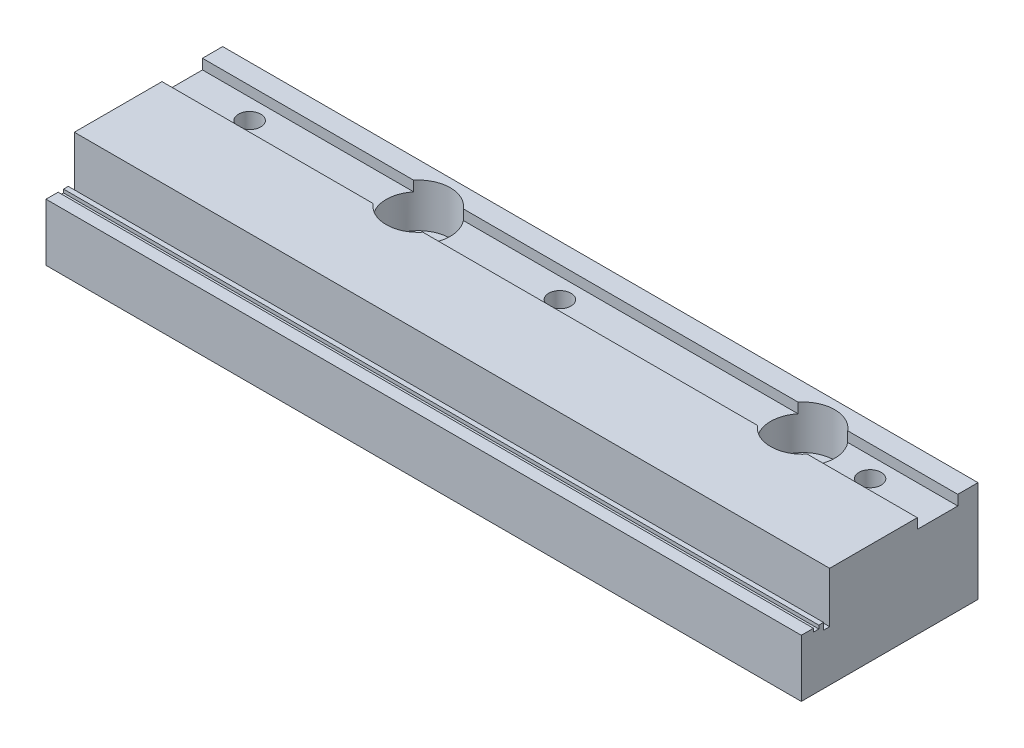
ISO-10303-21;
HEADER;
FILE_DESCRIPTION(('STEP AP214'),'2;1');
FILE_NAME('part.step','',(''),(''),'','','');
FILE_SCHEMA(('AUTOMOTIVE_DESIGN { 1 0 10303 214 1 1 1 1 }'));
ENDSEC;
DATA;
#1=APPLICATION_CONTEXT('core data for automotive mechanical design processes');
#2=APPLICATION_PROTOCOL_DEFINITION('international standard','automotive_design',2000,#1);
#3=PRODUCT_CONTEXT('',#1,'mechanical');
#4=PRODUCT('Part','Part','',(#3));
#5=PRODUCT_RELATED_PRODUCT_CATEGORY('part','',(#4));
#6=PRODUCT_DEFINITION_FORMATION('','',#4);
#7=PRODUCT_DEFINITION_CONTEXT('part definition',#1,'design');
#8=PRODUCT_DEFINITION('design','',#6,#7);
#9=PRODUCT_DEFINITION_SHAPE('','',#8);
#10=(LENGTH_UNIT() NAMED_UNIT(*) SI_UNIT(.MILLI.,.METRE.));
#11=(NAMED_UNIT(*) PLANE_ANGLE_UNIT() SI_UNIT($,.RADIAN.));
#12=(NAMED_UNIT(*) SI_UNIT($,.STERADIAN.) SOLID_ANGLE_UNIT());
#13=UNCERTAINTY_MEASURE_WITH_UNIT(LENGTH_MEASURE(1.E-05),#10,'distance_accuracy_value','');
#14=(GEOMETRIC_REPRESENTATION_CONTEXT(3) GLOBAL_UNCERTAINTY_ASSIGNED_CONTEXT((#13)) GLOBAL_UNIT_ASSIGNED_CONTEXT((#10,
#11,#12)) REPRESENTATION_CONTEXT('',''));
#15=CARTESIAN_POINT('',(0.,0.,0.));
#16=DIRECTION('',(0.,0.,1.));
#17=DIRECTION('',(1.,0.,0.));
#18=AXIS2_PLACEMENT_3D('',#15,#16,#17);
#19=CARTESIAN_POINT('',(0.,13.5,9.));
#20=DIRECTION('',(0.,1.,0.));
#21=DIRECTION('',(0.,0.,1.));
#22=AXIS2_PLACEMENT_3D('',#19,#20,#21);
#23=PLANE('',#22);
#24=CARTESIAN_POINT('',(92.,13.5,6.));
#25=DIRECTION('',(0.,1.,0.));
#26=DIRECTION('',(0.,0.,1.));
#27=AXIS2_PLACEMENT_3D('',#24,#25,#26);
#28=CIRCLE('',#27,4.75);
#29=CARTESIAN_POINT('',(95.6827299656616,13.5,9.00000000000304));
#30=VERTEX_POINT('',#29);
#31=CARTESIAN_POINT('',(95.6827299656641,13.5,3.));
#32=VERTEX_POINT('',#31);
#33=EDGE_CURVE('E198',#30,#32,#28,.T.);
#34=ORIENTED_EDGE('',*,*,#33,.F.);
#35=DIRECTION('',(1.,0.,0.));
#36=VECTOR('',#35,1.);
#37=CARTESIAN_POINT('',(0.,13.5,9.));
#38=LINE('',#37,#36);
#39=CARTESIAN_POINT('',(112.,13.5,9.));
#40=VERTEX_POINT('',#39);
#41=EDGE_CURVE('E233',#30,#40,#38,.T.);
#42=ORIENTED_EDGE('',*,*,#41,.T.);
#43=DIRECTION('',(0.,0.,1.));
#44=VECTOR('',#43,1.);
#45=CARTESIAN_POINT('',(112.,13.5,9.));
#46=LINE('',#45,#44);
#47=CARTESIAN_POINT('',(112.,13.5,3.));
#48=VERTEX_POINT('',#47);
#49=EDGE_CURVE('E310',#48,#40,#46,.T.);
#50=ORIENTED_EDGE('',*,*,#49,.F.);
#51=DIRECTION('',(1.,0.,0.));
#52=VECTOR('',#51,1.);
#53=CARTESIAN_POINT('',(0.,13.5,3.));
#54=LINE('',#53,#52);
#55=EDGE_CURVE('E225',#32,#48,#54,.T.);
#56=ORIENTED_EDGE('',*,*,#55,.F.);
#57=EDGE_LOOP('',(#34,#42,#50,#56));
#58=FACE_BOUND('',#57,.T.);
#59=CARTESIAN_POINT('',(102.000000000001,13.5,6.));
#60=DIRECTION('',(0.,1.,0.));
#61=DIRECTION('',(0.,0.,1.));
#62=AXIS2_PLACEMENT_3D('',#59,#60,#61);
#63=CIRCLE('',#62,1.65);
#64=CARTESIAN_POINT('',(102.000000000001,13.5,7.65));
#65=VERTEX_POINT('',#64);
#66=EDGE_CURVE('E360',#65,#65,#63,.T.);
#67=ORIENTED_EDGE('',*,*,#66,.F.);
#68=EDGE_LOOP('',(#67));
#69=FACE_BOUND('',#68,.T.);
#70=ADVANCED_FACE('F33',(#58,#69),#23,.T.);
#71=CARTESIAN_POINT('',(0.,13.5,3.));
#72=DIRECTION('',(0.,0.,1.));
#73=DIRECTION('',(1.,0.,0.));
#74=AXIS2_PLACEMENT_3D('',#71,#72,#73);
#75=PLANE('',#74);
#76=DIRECTION('',(0.,1.,0.));
#77=VECTOR('',#76,1.);
#78=CARTESIAN_POINT('',(95.6827299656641,8.5,3.));
#79=LINE('',#78,#77);
#80=CARTESIAN_POINT('',(95.6827299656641,15.,3.));
#81=VERTEX_POINT('',#80);
#82=EDGE_CURVE('E191',#32,#81,#79,.T.);
#83=ORIENTED_EDGE('',*,*,#82,.F.);
#84=ORIENTED_EDGE('',*,*,#55,.T.);
#85=DIRECTION('',(0.,-1.,0.));
#86=VECTOR('',#85,1.);
#87=CARTESIAN_POINT('',(112.,13.5,3.));
#88=LINE('',#87,#86);
#89=CARTESIAN_POINT('',(112.,15.,3.));
#90=VERTEX_POINT('',#89);
#91=EDGE_CURVE('E215',#90,#48,#88,.T.);
#92=ORIENTED_EDGE('',*,*,#91,.F.);
#93=DIRECTION('',(1.,0.,0.));
#94=VECTOR('',#93,1.);
#95=CARTESIAN_POINT('',(0.,15.,3.));
#96=LINE('',#95,#94);
#97=EDGE_CURVE('E207',#81,#90,#96,.T.);
#98=ORIENTED_EDGE('',*,*,#97,.F.);
#99=EDGE_LOOP('',(#83,#84,#92,#98));
#100=FACE_BOUND('',#99,.T.);
#101=ADVANCED_FACE('F213',(#100),#75,.T.);
#102=CARTESIAN_POINT('',(0.,13.5,9.));
#103=DIRECTION('',(0.,-6.07153216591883E-13,-1.));
#104=DIRECTION('',(0.,1.,-6.07153216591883E-13));
#105=AXIS2_PLACEMENT_3D('',#102,#103,#104);
#106=PLANE('',#105);
#107=DIRECTION('',(0.,1.,0.));
#108=VECTOR('',#107,1.);
#109=CARTESIAN_POINT('',(88.3172700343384,8.50000000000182,9.00000000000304));
#110=LINE('',#109,#108);
#111=CARTESIAN_POINT('',(88.3172700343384,13.5,9.00000000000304));
#112=VERTEX_POINT('',#111);
#113=CARTESIAN_POINT('',(88.3172700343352,15.,8.99999999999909));
#114=VERTEX_POINT('',#113);
#115=EDGE_CURVE('E12',#112,#114,#110,.T.);
#116=ORIENTED_EDGE('',*,*,#115,.F.);
#117=CARTESIAN_POINT('',(38.6827299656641,13.5,9.));
#118=VERTEX_POINT('',#117);
#119=EDGE_CURVE('E236',#118,#112,#38,.T.);
#120=ORIENTED_EDGE('',*,*,#119,.F.);
#121=DIRECTION('',(0.,1.,0.));
#122=VECTOR('',#121,1.);
#123=CARTESIAN_POINT('',(38.6827299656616,8.50000000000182,9.00000000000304));
#124=LINE('',#123,#122);
#125=CARTESIAN_POINT('',(38.6827299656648,15.,8.99999999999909));
#126=VERTEX_POINT('',#125);
#127=EDGE_CURVE('E363',#126,#118,#124,.F.);
#128=ORIENTED_EDGE('',*,*,#127,.F.);
#129=DIRECTION('',(1.,0.,0.));
#130=VECTOR('',#129,1.);
#131=CARTESIAN_POINT('',(0.,15.,8.99999999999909));
#132=LINE('',#131,#130);
#133=EDGE_CURVE('E248',#126,#114,#132,.T.);
#134=ORIENTED_EDGE('',*,*,#133,.T.);
#135=EDGE_LOOP('',(#116,#120,#128,#134));
#136=FACE_BOUND('',#135,.T.);
#137=ADVANCED_FACE('F483',(#136),#106,.T.);
#138=CARTESIAN_POINT('',(92.,-12.7,6.));
#139=DIRECTION('',(0.,1.,0.));
#140=DIRECTION('',(0.,0.,1.));
#141=AXIS2_PLACEMENT_3D('',#138,#139,#140);
#142=CYLINDRICAL_SURFACE('',#141,2.75);
#143=CARTESIAN_POINT('',(92.,0.,6.));
#144=DIRECTION('',(0.,1.,0.));
#145=DIRECTION('',(0.,0.,1.));
#146=AXIS2_PLACEMENT_3D('',#143,#144,#145);
#147=CIRCLE('',#146,2.75);
#148=CARTESIAN_POINT('',(92.,0.,8.75));
#149=VERTEX_POINT('',#148);
#150=EDGE_CURVE('E342',#149,#149,#147,.T.);
#151=ORIENTED_EDGE('',*,*,#150,.F.);
#152=EDGE_LOOP('',(#151));
#153=FACE_BOUND('',#152,.T.);
#154=CARTESIAN_POINT('',(92.,8.5,6.));
#155=DIRECTION('',(0.,1.,0.));
#156=DIRECTION('',(0.,0.,1.));
#157=AXIS2_PLACEMENT_3D('',#154,#155,#156);
#158=CIRCLE('',#157,2.75);
#159=CARTESIAN_POINT('',(92.,8.5,8.75));
#160=VERTEX_POINT('',#159);
#161=EDGE_CURVE('E378',#160,#160,#158,.F.);
#162=ORIENTED_EDGE('',*,*,#161,.F.);
#163=EDGE_LOOP('',(#162));
#164=FACE_BOUND('',#163,.T.);
#165=ADVANCED_FACE('F505',(#153,#164),#142,.F.);
#166=DIRECTION('',(0.,1.,0.));
#167=VECTOR('',#166,1.);
#168=CARTESIAN_POINT('',(31.3172700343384,8.50000000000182,9.00000000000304));
#169=LINE('',#168,#167);
#170=CARTESIAN_POINT('',(31.3172700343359,13.5,9.));
#171=VERTEX_POINT('',#170);
#172=CARTESIAN_POINT('',(31.3172700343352,15.,8.99999999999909));
#173=VERTEX_POINT('',#172);
#174=EDGE_CURVE('E366',#171,#173,#169,.T.);
#175=ORIENTED_EDGE('',*,*,#174,.F.);
#176=CARTESIAN_POINT('',(0.,13.5,9.));
#177=VERTEX_POINT('',#176);
#178=EDGE_CURVE('E237',#177,#171,#38,.T.);
#179=ORIENTED_EDGE('',*,*,#178,.F.);
#180=DIRECTION('',(0.,1.,-6.07153216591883E-13));
#181=VECTOR('',#180,1.);
#182=CARTESIAN_POINT('',(0.,13.5,9.));
#183=LINE('',#182,#181);
#184=CARTESIAN_POINT('',(0.,15.,8.99999999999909));
#185=VERTEX_POINT('',#184);
#186=EDGE_CURVE('E335',#177,#185,#183,.T.);
#187=ORIENTED_EDGE('',*,*,#186,.T.);
#188=EDGE_CURVE('E249',#185,#173,#132,.T.);
#189=ORIENTED_EDGE('',*,*,#188,.T.);
#190=EDGE_LOOP('',(#175,#179,#187,#189));
#191=FACE_BOUND('',#190,.T.);
#192=ADVANCED_FACE('F495',(#191),#106,.T.);
#193=CARTESIAN_POINT('',(88.3172700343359,13.5,3.));
#194=VERTEX_POINT('',#193);
#195=EDGE_CURVE('E202',#194,#112,#28,.T.);
#196=ORIENTED_EDGE('',*,*,#195,.F.);
#197=CARTESIAN_POINT('',(38.6827299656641,13.5,3.));
#198=VERTEX_POINT('',#197);
#199=EDGE_CURVE('E227',#198,#194,#54,.T.);
#200=ORIENTED_EDGE('',*,*,#199,.F.);
#201=CARTESIAN_POINT('',(35.,13.5,6.));
#202=DIRECTION('',(0.,1.,0.));
#203=DIRECTION('',(0.,0.,1.));
#204=AXIS2_PLACEMENT_3D('',#201,#202,#203);
#205=CIRCLE('',#204,4.75);
#206=EDGE_CURVE('E365',#118,#198,#205,.T.);
#207=ORIENTED_EDGE('',*,*,#206,.F.);
#208=ORIENTED_EDGE('',*,*,#119,.T.);
#209=EDGE_LOOP('',(#196,#200,#207,#208));
#210=FACE_BOUND('',#209,.T.);
#211=CARTESIAN_POINT('',(56.0000000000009,13.5,6.));
#212=DIRECTION('',(0.,1.,0.));
#213=DIRECTION('',(0.,0.,1.));
#214=AXIS2_PLACEMENT_3D('',#211,#212,#213);
#215=CIRCLE('',#214,1.65);
#216=CARTESIAN_POINT('',(56.0000000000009,13.5,7.65));
#217=VERTEX_POINT('',#216);
#218=EDGE_CURVE('E354',#217,#217,#215,.T.);
#219=ORIENTED_EDGE('',*,*,#218,.F.);
#220=EDGE_LOOP('',(#219));
#221=FACE_BOUND('',#220,.T.);
#222=ADVANCED_FACE('F486',(#210,#221),#23,.T.);
#223=DIRECTION('',(0.,1.,0.));
#224=VECTOR('',#223,1.);
#225=CARTESIAN_POINT('',(88.3172700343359,8.5,3.));
#226=LINE('',#225,#224);
#227=CARTESIAN_POINT('',(88.3172700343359,15.,3.));
#228=VERTEX_POINT('',#227);
#229=EDGE_CURVE('E373',#228,#194,#226,.F.);
#230=ORIENTED_EDGE('',*,*,#229,.F.);
#231=CARTESIAN_POINT('',(38.6827299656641,15.,3.));
#232=VERTEX_POINT('',#231);
#233=EDGE_CURVE('E210',#232,#228,#96,.T.);
#234=ORIENTED_EDGE('',*,*,#233,.F.);
#235=DIRECTION('',(0.,1.,0.));
#236=VECTOR('',#235,1.);
#237=CARTESIAN_POINT('',(38.6827299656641,8.5,3.));
#238=LINE('',#237,#236);
#239=EDGE_CURVE('E388',#198,#232,#238,.T.);
#240=ORIENTED_EDGE('',*,*,#239,.F.);
#241=ORIENTED_EDGE('',*,*,#199,.T.);
#242=EDGE_LOOP('',(#230,#234,#240,#241));
#243=FACE_BOUND('',#242,.T.);
#244=ADVANCED_FACE('F490',(#243),#75,.T.);
#245=CARTESIAN_POINT('',(35.,-12.7,6.));
#246=DIRECTION('',(0.,1.,0.));
#247=DIRECTION('',(0.,0.,1.));
#248=AXIS2_PLACEMENT_3D('',#245,#246,#247);
#249=CYLINDRICAL_SURFACE('',#248,2.75);
#250=CARTESIAN_POINT('',(35.,0.,6.));
#251=DIRECTION('',(0.,1.,0.));
#252=DIRECTION('',(0.,0.,1.));
#253=AXIS2_PLACEMENT_3D('',#250,#251,#252);
#254=CIRCLE('',#253,2.75);
#255=CARTESIAN_POINT('',(35.,0.,8.75));
#256=VERTEX_POINT('',#255);
#257=EDGE_CURVE('E313',#256,#256,#254,.T.);
#258=ORIENTED_EDGE('',*,*,#257,.F.);
#259=EDGE_LOOP('',(#258));
#260=FACE_BOUND('',#259,.T.);
#261=CARTESIAN_POINT('',(35.,8.5,6.));
#262=DIRECTION('',(0.,1.,0.));
#263=DIRECTION('',(0.,0.,1.));
#264=AXIS2_PLACEMENT_3D('',#261,#262,#263);
#265=CIRCLE('',#264,2.75);
#266=CARTESIAN_POINT('',(35.,8.5,8.75));
#267=VERTEX_POINT('',#266);
#268=EDGE_CURVE('E370',#267,#267,#265,.F.);
#269=ORIENTED_EDGE('',*,*,#268,.F.);
#270=EDGE_LOOP('',(#269));
#271=FACE_BOUND('',#270,.T.);
#272=ADVANCED_FACE('F517',(#260,#271),#249,.F.);
#273=CARTESIAN_POINT('',(0.,0.,26.2));
#274=DIRECTION('',(1.,0.,0.));
#275=DIRECTION('',(0.,0.,-1.));
#276=AXIS2_PLACEMENT_3D('',#273,#274,#275);
#277=PLANE('',#276);
#278=DIRECTION('',(0.,0.,1.));
#279=VECTOR('',#278,1.);
#280=CARTESIAN_POINT('',(0.,8.5,26.1999999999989));
#281=LINE('',#280,#279);
#282=CARTESIAN_POINT('',(0.,8.5,24.3999999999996));
#283=VERTEX_POINT('',#282);
#284=CARTESIAN_POINT('',(0.,8.5,26.2));
#285=VERTEX_POINT('',#284);
#286=EDGE_CURVE('E217',#283,#285,#281,.T.);
#287=ORIENTED_EDGE('',*,*,#286,.F.);
#288=DIRECTION('',(0.,1.,0.));
#289=VECTOR('',#288,1.);
#290=CARTESIAN_POINT('',(0.,8.5,24.3999999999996));
#291=LINE('',#290,#289);
#292=CARTESIAN_POINT('',(0.,8.,24.3999999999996));
#293=VERTEX_POINT('',#292);
#294=EDGE_CURVE('E220',#293,#283,#291,.T.);
#295=ORIENTED_EDGE('',*,*,#294,.F.);
#296=DIRECTION('',(0.,0.,1.));
#297=VECTOR('',#296,1.);
#298=CARTESIAN_POINT('',(0.,8.,24.3999999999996));
#299=LINE('',#298,#297);
#300=CARTESIAN_POINT('',(0.,8.,23.6000000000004));
#301=VERTEX_POINT('',#300);
#302=EDGE_CURVE('E317',#301,#293,#299,.T.);
#303=ORIENTED_EDGE('',*,*,#302,.F.);
#304=DIRECTION('',(0.,-1.,0.));
#305=VECTOR('',#304,1.);
#306=CARTESIAN_POINT('',(0.,8.5,23.6000000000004));
#307=LINE('',#306,#305);
#308=CARTESIAN_POINT('',(0.,8.5,23.6000000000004));
#309=VERTEX_POINT('',#308);
#310=EDGE_CURVE('E320',#309,#301,#307,.T.);
#311=ORIENTED_EDGE('',*,*,#310,.F.);
#312=DIRECTION('',(0.,0.,1.));
#313=VECTOR('',#312,1.);
#314=CARTESIAN_POINT('',(0.,8.5,23.6000000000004));
#315=LINE('',#314,#313);
#316=CARTESIAN_POINT('',(0.,8.5,22.8999999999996));
#317=VERTEX_POINT('',#316);
#318=EDGE_CURVE('E323',#317,#309,#315,.T.);
#319=ORIENTED_EDGE('',*,*,#318,.F.);
#320=DIRECTION('',(0.,1.,0.));
#321=VECTOR('',#320,1.);
#322=CARTESIAN_POINT('',(0.,7.5,22.8999999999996));
#323=LINE('',#322,#321);
#324=CARTESIAN_POINT('',(0.,7.5,22.8999999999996));
#325=VERTEX_POINT('',#324);
#326=EDGE_CURVE('E326',#325,#317,#323,.T.);
#327=ORIENTED_EDGE('',*,*,#326,.F.);
#328=DIRECTION('',(0.,0.,1.));
#329=VECTOR('',#328,1.);
#330=CARTESIAN_POINT('',(0.,7.5,22.8999999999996));
#331=LINE('',#330,#329);
#332=CARTESIAN_POINT('',(0.,7.5,22.));
#333=VERTEX_POINT('',#332);
#334=EDGE_CURVE('E329',#333,#325,#331,.T.);
#335=ORIENTED_EDGE('',*,*,#334,.F.);
#336=DIRECTION('',(0.,-1.,0.));
#337=VECTOR('',#336,1.);
#338=CARTESIAN_POINT('',(0.,7.5,22.));
#339=LINE('',#338,#337);
#340=CARTESIAN_POINT('',(0.,15.,22.));
#341=VERTEX_POINT('',#340);
#342=EDGE_CURVE('E332',#341,#333,#339,.T.);
#343=ORIENTED_EDGE('',*,*,#342,.F.);
#344=DIRECTION('',(0.,0.,-1.));
#345=VECTOR('',#344,1.);
#346=CARTESIAN_POINT('',(0.,15.,26.2));
#347=LINE('',#346,#345);
#348=EDGE_CURVE('E404',#341,#185,#347,.T.);
#349=ORIENTED_EDGE('',*,*,#348,.T.);
#350=ORIENTED_EDGE('',*,*,#186,.F.);
#351=DIRECTION('',(0.,0.,1.));
#352=VECTOR('',#351,1.);
#353=CARTESIAN_POINT('',(0.,13.5,9.));
#354=LINE('',#353,#352);
#355=CARTESIAN_POINT('',(0.,13.5,3.));
#356=VERTEX_POINT('',#355);
#357=EDGE_CURVE('E337',#356,#177,#354,.T.);
#358=ORIENTED_EDGE('',*,*,#357,.F.);
#359=DIRECTION('',(0.,-1.,0.));
#360=VECTOR('',#359,1.);
#361=CARTESIAN_POINT('',(0.,13.5,3.));
#362=LINE('',#361,#360);
#363=CARTESIAN_POINT('',(0.,15.,3.));
#364=VERTEX_POINT('',#363);
#365=EDGE_CURVE('E286',#364,#356,#362,.T.);
#366=ORIENTED_EDGE('',*,*,#365,.F.);
#367=CARTESIAN_POINT('',(0.,15.,0.));
#368=VERTEX_POINT('',#367);
#369=EDGE_CURVE('E405',#364,#368,#347,.T.);
#370=ORIENTED_EDGE('',*,*,#369,.T.);
#371=DIRECTION('',(0.,-1.,0.));
#372=VECTOR('',#371,1.);
#373=CARTESIAN_POINT('',(0.,0.,0.));
#374=LINE('',#373,#372);
#375=CARTESIAN_POINT('',(0.,0.,0.));
#376=VERTEX_POINT('',#375);
#377=EDGE_CURVE('E282',#368,#376,#374,.T.);
#378=ORIENTED_EDGE('',*,*,#377,.T.);
#379=DIRECTION('',(0.,0.,-1.));
#380=VECTOR('',#379,1.);
#381=CARTESIAN_POINT('',(0.,0.,26.2));
#382=LINE('',#381,#380);
#383=CARTESIAN_POINT('',(0.,0.,26.2));
#384=VERTEX_POINT('',#383);
#385=EDGE_CURVE('E392',#384,#376,#382,.T.);
#386=ORIENTED_EDGE('',*,*,#385,.F.);
#387=DIRECTION('',(0.,-1.,0.));
#388=VECTOR('',#387,1.);
#389=CARTESIAN_POINT('',(0.,0.,26.2));
#390=LINE('',#389,#388);
#391=EDGE_CURVE('E411',#285,#384,#390,.T.);
#392=ORIENTED_EDGE('',*,*,#391,.F.);
#393=EDGE_LOOP('',(#287,#295,#303,#311,#319,#327,#335,#343,#349,#350,#358,#366,#370,#378,#386,#392));
#394=FACE_BOUND('',#393,.T.);
#395=ADVANCED_FACE('F35',(#394),#277,.F.);
#396=CARTESIAN_POINT('',(112.,0.,26.2));
#397=DIRECTION('',(-1.,0.,0.));
#398=DIRECTION('',(0.,0.,1.));
#399=AXIS2_PLACEMENT_3D('',#396,#397,#398);
#400=PLANE('',#399);
#401=DIRECTION('',(0.,0.,1.));
#402=VECTOR('',#401,1.);
#403=CARTESIAN_POINT('',(112.,8.5,26.1999999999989));
#404=LINE('',#403,#402);
#405=CARTESIAN_POINT('',(112.,8.5,24.3999999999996));
#406=VERTEX_POINT('',#405);
#407=CARTESIAN_POINT('',(112.,8.5,26.1999999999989));
#408=VERTEX_POINT('',#407);
#409=EDGE_CURVE('E283',#406,#408,#404,.T.);
#410=ORIENTED_EDGE('',*,*,#409,.T.);
#411=DIRECTION('',(0.,1.,0.));
#412=VECTOR('',#411,1.);
#413=CARTESIAN_POINT('',(112.,0.,26.2));
#414=LINE('',#413,#412);
#415=CARTESIAN_POINT('',(112.,0.,26.2));
#416=VERTEX_POINT('',#415);
#417=EDGE_CURVE('E407',#416,#408,#414,.T.);
#418=ORIENTED_EDGE('',*,*,#417,.F.);
#419=DIRECTION('',(0.,0.,-1.));
#420=VECTOR('',#419,1.);
#421=CARTESIAN_POINT('',(112.,0.,26.2));
#422=LINE('',#421,#420);
#423=CARTESIAN_POINT('',(112.,0.,0.));
#424=VERTEX_POINT('',#423);
#425=EDGE_CURVE('E394',#416,#424,#422,.T.);
#426=ORIENTED_EDGE('',*,*,#425,.T.);
#427=DIRECTION('',(0.,1.,0.));
#428=VECTOR('',#427,1.);
#429=CARTESIAN_POINT('',(112.,0.,0.));
#430=LINE('',#429,#428);
#431=CARTESIAN_POINT('',(112.,15.,0.));
#432=VERTEX_POINT('',#431);
#433=EDGE_CURVE('E412',#424,#432,#430,.T.);
#434=ORIENTED_EDGE('',*,*,#433,.T.);
#435=DIRECTION('',(0.,0.,-1.));
#436=VECTOR('',#435,1.);
#437=CARTESIAN_POINT('',(112.,15.,26.2));
#438=LINE('',#437,#436);
#439=EDGE_CURVE('E402',#90,#432,#438,.T.);
#440=ORIENTED_EDGE('',*,*,#439,.F.);
#441=ORIENTED_EDGE('',*,*,#91,.T.);
#442=ORIENTED_EDGE('',*,*,#49,.T.);
#443=DIRECTION('',(0.,1.,-6.07153216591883E-13));
#444=VECTOR('',#443,1.);
#445=CARTESIAN_POINT('',(112.,13.5,9.));
#446=LINE('',#445,#444);
#447=CARTESIAN_POINT('',(112.,15.,8.99999999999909));
#448=VERTEX_POINT('',#447);
#449=EDGE_CURVE('E308',#40,#448,#446,.T.);
#450=ORIENTED_EDGE('',*,*,#449,.T.);
#451=CARTESIAN_POINT('',(112.,15.,22.));
#452=VERTEX_POINT('',#451);
#453=EDGE_CURVE('E401',#452,#448,#438,.T.);
#454=ORIENTED_EDGE('',*,*,#453,.F.);
#455=DIRECTION('',(0.,-1.,0.));
#456=VECTOR('',#455,1.);
#457=CARTESIAN_POINT('',(112.,7.5,22.));
#458=LINE('',#457,#456);
#459=CARTESIAN_POINT('',(112.,7.5,22.));
#460=VERTEX_POINT('',#459);
#461=EDGE_CURVE('E305',#452,#460,#458,.T.);
#462=ORIENTED_EDGE('',*,*,#461,.T.);
#463=DIRECTION('',(0.,0.,1.));
#464=VECTOR('',#463,1.);
#465=CARTESIAN_POINT('',(112.,7.5,22.8999999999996));
#466=LINE('',#465,#464);
#467=CARTESIAN_POINT('',(112.,7.5,22.8999999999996));
#468=VERTEX_POINT('',#467);
#469=EDGE_CURVE('E302',#460,#468,#466,.T.);
#470=ORIENTED_EDGE('',*,*,#469,.T.);
#471=DIRECTION('',(0.,1.,0.));
#472=VECTOR('',#471,1.);
#473=CARTESIAN_POINT('',(112.,7.5,22.8999999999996));
#474=LINE('',#473,#472);
#475=CARTESIAN_POINT('',(112.,8.5,22.8999999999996));
#476=VERTEX_POINT('',#475);
#477=EDGE_CURVE('E299',#468,#476,#474,.T.);
#478=ORIENTED_EDGE('',*,*,#477,.T.);
#479=DIRECTION('',(0.,0.,1.));
#480=VECTOR('',#479,1.);
#481=CARTESIAN_POINT('',(112.,8.5,23.6000000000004));
#482=LINE('',#481,#480);
#483=CARTESIAN_POINT('',(112.,8.5,23.6000000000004));
#484=VERTEX_POINT('',#483);
#485=EDGE_CURVE('E296',#476,#484,#482,.T.);
#486=ORIENTED_EDGE('',*,*,#485,.T.);
#487=DIRECTION('',(0.,-1.,0.));
#488=VECTOR('',#487,1.);
#489=CARTESIAN_POINT('',(112.,8.5,23.6000000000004));
#490=LINE('',#489,#488);
#491=CARTESIAN_POINT('',(112.,8.,23.6000000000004));
#492=VERTEX_POINT('',#491);
#493=EDGE_CURVE('E293',#484,#492,#490,.T.);
#494=ORIENTED_EDGE('',*,*,#493,.T.);
#495=DIRECTION('',(0.,0.,1.));
#496=VECTOR('',#495,1.);
#497=CARTESIAN_POINT('',(112.,8.,24.3999999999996));
#498=LINE('',#497,#496);
#499=CARTESIAN_POINT('',(112.,8.,24.3999999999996));
#500=VERTEX_POINT('',#499);
#501=EDGE_CURVE('E290',#492,#500,#498,.T.);
#502=ORIENTED_EDGE('',*,*,#501,.T.);
#503=DIRECTION('',(0.,1.,0.));
#504=VECTOR('',#503,1.);
#505=CARTESIAN_POINT('',(112.,8.5,24.3999999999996));
#506=LINE('',#505,#504);
#507=EDGE_CURVE('E287',#500,#406,#506,.T.);
#508=ORIENTED_EDGE('',*,*,#507,.T.);
#509=EDGE_LOOP('',(#410,#418,#426,#434,#440,#441,#442,#450,#454,#462,#470,#478,#486,#494,#502,#508));
#510=FACE_BOUND('',#509,.T.);
#511=ADVANCED_FACE('F441',(#510),#400,.F.);
#512=CARTESIAN_POINT('',(0.,15.,26.2));
#513=DIRECTION('',(0.,-1.,0.));
#514=DIRECTION('',(0.,0.,-1.));
#515=AXIS2_PLACEMENT_3D('',#512,#513,#514);
#516=PLANE('',#515);
#517=CARTESIAN_POINT('',(95.6827299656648,15.,8.99999999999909));
#518=VERTEX_POINT('',#517);
#519=EDGE_CURVE('E244',#518,#448,#132,.T.);
#520=ORIENTED_EDGE('',*,*,#519,.F.);
#521=CARTESIAN_POINT('',(92.,15.,6.));
#522=DIRECTION('',(0.,1.,0.));
#523=DIRECTION('',(0.,0.,1.));
#524=AXIS2_PLACEMENT_3D('',#521,#522,#523);
#525=CIRCLE('',#524,4.75);
#526=EDGE_CURVE('E47',#114,#518,#525,.T.);
#527=ORIENTED_EDGE('',*,*,#526,.F.);
#528=ORIENTED_EDGE('',*,*,#133,.F.);
#529=CARTESIAN_POINT('',(35.,15.,6.));
#530=DIRECTION('',(0.,1.,0.));
#531=DIRECTION('',(0.,0.,1.));
#532=AXIS2_PLACEMENT_3D('',#529,#530,#531);
#533=CIRCLE('',#532,4.75);
#534=EDGE_CURVE('E371',#173,#126,#533,.T.);
#535=ORIENTED_EDGE('',*,*,#534,.F.);
#536=ORIENTED_EDGE('',*,*,#188,.F.);
#537=ORIENTED_EDGE('',*,*,#348,.F.);
#538=DIRECTION('',(1.,0.,0.));
#539=VECTOR('',#538,1.);
#540=CARTESIAN_POINT('',(0.,15.,22.));
#541=LINE('',#540,#539);
#542=EDGE_CURVE('E256',#341,#452,#541,.T.);
#543=ORIENTED_EDGE('',*,*,#542,.T.);
#544=ORIENTED_EDGE('',*,*,#453,.T.);
#545=EDGE_LOOP('',(#520,#527,#528,#535,#536,#537,#543,#544));
#546=FACE_BOUND('',#545,.T.);
#547=ADVANCED_FACE('F473',(#546),#516,.F.);
#548=ORIENTED_EDGE('',*,*,#233,.T.);
#549=EDGE_CURVE('E195',#81,#228,#525,.T.);
#550=ORIENTED_EDGE('',*,*,#549,.F.);
#551=ORIENTED_EDGE('',*,*,#97,.T.);
#552=ORIENTED_EDGE('',*,*,#439,.T.);
#553=DIRECTION('',(-1.,0.,0.));
#554=VECTOR('',#553,1.);
#555=CARTESIAN_POINT('',(0.,15.,0.));
#556=LINE('',#555,#554);
#557=EDGE_CURVE('E408',#432,#368,#556,.T.);
#558=ORIENTED_EDGE('',*,*,#557,.T.);
#559=ORIENTED_EDGE('',*,*,#369,.F.);
#560=CARTESIAN_POINT('',(31.3172700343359,15.,3.));
#561=VERTEX_POINT('',#560);
#562=EDGE_CURVE('E219',#364,#561,#96,.T.);
#563=ORIENTED_EDGE('',*,*,#562,.T.);
#564=EDGE_CURVE('E55',#232,#561,#533,.T.);
#565=ORIENTED_EDGE('',*,*,#564,.F.);
#566=EDGE_LOOP('',(#548,#550,#551,#552,#558,#559,#563,#565));
#567=FACE_BOUND('',#566,.T.);
#568=ADVANCED_FACE('F206',(#567),#516,.F.);
#569=CARTESIAN_POINT('',(0.,15.,26.2));
#570=DIRECTION('',(0.,0.,-1.));
#571=DIRECTION('',(-1.,0.,0.));
#572=AXIS2_PLACEMENT_3D('',#569,#570,#571);
#573=PLANE('',#572);
#574=DIRECTION('',(1.,0.,0.));
#575=VECTOR('',#574,1.);
#576=CARTESIAN_POINT('',(0.,8.5,26.1999999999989));
#577=LINE('',#576,#575);
#578=EDGE_CURVE('E280',#285,#408,#577,.T.);
#579=ORIENTED_EDGE('',*,*,#578,.F.);
#580=ORIENTED_EDGE('',*,*,#391,.T.);
#581=DIRECTION('',(1.,0.,0.));
#582=VECTOR('',#581,1.);
#583=CARTESIAN_POINT('',(0.,0.,26.2));
#584=LINE('',#583,#582);
#585=EDGE_CURVE('E421',#384,#416,#584,.T.);
#586=ORIENTED_EDGE('',*,*,#585,.T.);
#587=ORIENTED_EDGE('',*,*,#417,.T.);
#588=EDGE_LOOP('',(#579,#580,#586,#587));
#589=FACE_BOUND('',#588,.T.);
#590=ADVANCED_FACE('F426',(#589),#573,.F.);
#591=CARTESIAN_POINT('',(0.,0.,26.2));
#592=DIRECTION('',(0.,1.,0.));
#593=DIRECTION('',(0.,0.,1.));
#594=AXIS2_PLACEMENT_3D('',#591,#592,#593);
#595=PLANE('',#594);
#596=CARTESIAN_POINT('',(102.000000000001,0.,6.));
#597=DIRECTION('',(0.,1.,0.));
#598=DIRECTION('',(0.,0.,1.));
#599=AXIS2_PLACEMENT_3D('',#596,#597,#598);
#600=CIRCLE('',#599,1.65);
#601=CARTESIAN_POINT('',(102.000000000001,0.,7.65));
#602=VERTEX_POINT('',#601);
#603=EDGE_CURVE('E357',#602,#602,#600,.T.);
#604=ORIENTED_EDGE('',*,*,#603,.T.);
#605=EDGE_LOOP('',(#604));
#606=FACE_BOUND('',#605,.T.);
#607=CARTESIAN_POINT('',(56.0000000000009,0.,6.));
#608=DIRECTION('',(0.,1.,0.));
#609=DIRECTION('',(0.,0.,1.));
#610=AXIS2_PLACEMENT_3D('',#607,#608,#609);
#611=CIRCLE('',#610,1.65);
#612=CARTESIAN_POINT('',(56.0000000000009,0.,7.65));
#613=VERTEX_POINT('',#612);
#614=EDGE_CURVE('E351',#613,#613,#611,.T.);
#615=ORIENTED_EDGE('',*,*,#614,.T.);
#616=EDGE_LOOP('',(#615));
#617=FACE_BOUND('',#616,.T.);
#618=CARTESIAN_POINT('',(9.99999999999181,0.,6.));
#619=DIRECTION('',(0.,1.,0.));
#620=DIRECTION('',(0.,0.,1.));
#621=AXIS2_PLACEMENT_3D('',#618,#619,#620);
#622=CIRCLE('',#621,1.65);
#623=CARTESIAN_POINT('',(9.99999999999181,0.,7.65));
#624=VERTEX_POINT('',#623);
#625=EDGE_CURVE('E345',#624,#624,#622,.T.);
#626=ORIENTED_EDGE('',*,*,#625,.T.);
#627=EDGE_LOOP('',(#626));
#628=FACE_BOUND('',#627,.T.);
#629=ORIENTED_EDGE('',*,*,#150,.T.);
#630=EDGE_LOOP('',(#629));
#631=FACE_BOUND('',#630,.T.);
#632=ORIENTED_EDGE('',*,*,#257,.T.);
#633=EDGE_LOOP('',(#632));
#634=FACE_BOUND('',#633,.T.);
#635=DIRECTION('',(1.,0.,0.));
#636=VECTOR('',#635,1.);
#637=CARTESIAN_POINT('',(0.,0.,0.));
#638=LINE('',#637,#636);
#639=EDGE_CURVE('E415',#376,#424,#638,.T.);
#640=ORIENTED_EDGE('',*,*,#639,.T.);
#641=ORIENTED_EDGE('',*,*,#425,.F.);
#642=ORIENTED_EDGE('',*,*,#585,.F.);
#643=ORIENTED_EDGE('',*,*,#385,.T.);
#644=EDGE_LOOP('',(#640,#641,#642,#643));
#645=FACE_BOUND('',#644,.T.);
#646=ADVANCED_FACE('F432',(#606,#617,#628,#631,#634,#645),#595,.F.);
#647=CARTESIAN_POINT('',(0.,15.,0.));
#648=DIRECTION('',(0.,0.,-1.));
#649=DIRECTION('',(-1.,0.,0.));
#650=AXIS2_PLACEMENT_3D('',#647,#648,#649);
#651=PLANE('',#650);
#652=ORIENTED_EDGE('',*,*,#377,.F.);
#653=ORIENTED_EDGE('',*,*,#557,.F.);
#654=ORIENTED_EDGE('',*,*,#433,.F.);
#655=ORIENTED_EDGE('',*,*,#639,.F.);
#656=EDGE_LOOP('',(#652,#653,#654,#655));
#657=FACE_BOUND('',#656,.T.);
#658=ADVANCED_FACE('F438',(#657),#651,.T.);
#659=CARTESIAN_POINT('',(0.,7.5,22.));
#660=DIRECTION('',(0.,0.,1.));
#661=DIRECTION('',(1.,0.,0.));
#662=AXIS2_PLACEMENT_3D('',#659,#660,#661);
#663=PLANE('',#662);
#664=ORIENTED_EDGE('',*,*,#461,.F.);
#665=ORIENTED_EDGE('',*,*,#542,.F.);
#666=ORIENTED_EDGE('',*,*,#342,.T.);
#667=DIRECTION('',(1.,0.,0.));
#668=VECTOR('',#667,1.);
#669=CARTESIAN_POINT('',(0.,7.5,22.));
#670=LINE('',#669,#668);
#671=EDGE_CURVE('E261',#333,#460,#670,.T.);
#672=ORIENTED_EDGE('',*,*,#671,.T.);
#673=EDGE_LOOP('',(#664,#665,#666,#672));
#674=FACE_BOUND('',#673,.T.);
#675=ADVANCED_FACE('F580',(#674),#663,.T.);
#676=CARTESIAN_POINT('',(0.,7.5,22.8999999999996));
#677=DIRECTION('',(0.,1.,0.));
#678=DIRECTION('',(0.,0.,1.));
#679=AXIS2_PLACEMENT_3D('',#676,#677,#678);
#680=PLANE('',#679);
#681=ORIENTED_EDGE('',*,*,#469,.F.);
#682=ORIENTED_EDGE('',*,*,#671,.F.);
#683=ORIENTED_EDGE('',*,*,#334,.T.);
#684=DIRECTION('',(1.,0.,0.));
#685=VECTOR('',#684,1.);
#686=CARTESIAN_POINT('',(0.,7.5,22.8999999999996));
#687=LINE('',#686,#685);
#688=EDGE_CURVE('E266',#325,#468,#687,.T.);
#689=ORIENTED_EDGE('',*,*,#688,.T.);
#690=EDGE_LOOP('',(#681,#682,#683,#689));
#691=FACE_BOUND('',#690,.T.);
#692=ADVANCED_FACE('F468',(#691),#680,.T.);
#693=CARTESIAN_POINT('',(0.,7.5,22.8999999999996));
#694=DIRECTION('',(0.,0.,-1.));
#695=DIRECTION('',(-1.,0.,0.));
#696=AXIS2_PLACEMENT_3D('',#693,#694,#695);
#697=PLANE('',#696);
#698=ORIENTED_EDGE('',*,*,#477,.F.);
#699=ORIENTED_EDGE('',*,*,#688,.F.);
#700=ORIENTED_EDGE('',*,*,#326,.T.);
#701=DIRECTION('',(1.,0.,0.));
#702=VECTOR('',#701,1.);
#703=CARTESIAN_POINT('',(0.,8.5,22.8999999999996));
#704=LINE('',#703,#702);
#705=EDGE_CURVE('E270',#317,#476,#704,.T.);
#706=ORIENTED_EDGE('',*,*,#705,.T.);
#707=EDGE_LOOP('',(#698,#699,#700,#706));
#708=FACE_BOUND('',#707,.T.);
#709=ADVANCED_FACE('F465',(#708),#697,.T.);
#710=CARTESIAN_POINT('',(0.,8.5,23.6000000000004));
#711=DIRECTION('',(0.,1.,0.));
#712=DIRECTION('',(0.,0.,1.));
#713=AXIS2_PLACEMENT_3D('',#710,#711,#712);
#714=PLANE('',#713);
#715=ORIENTED_EDGE('',*,*,#485,.F.);
#716=ORIENTED_EDGE('',*,*,#705,.F.);
#717=ORIENTED_EDGE('',*,*,#318,.T.);
#718=DIRECTION('',(1.,0.,0.));
#719=VECTOR('',#718,1.);
#720=CARTESIAN_POINT('',(0.,8.5,23.6000000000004));
#721=LINE('',#720,#719);
#722=EDGE_CURVE('E272',#309,#484,#721,.T.);
#723=ORIENTED_EDGE('',*,*,#722,.T.);
#724=EDGE_LOOP('',(#715,#716,#717,#723));
#725=FACE_BOUND('',#724,.T.);
#726=ADVANCED_FACE('F462',(#725),#714,.T.);
#727=CARTESIAN_POINT('',(0.,8.5,23.6000000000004));
#728=DIRECTION('',(0.,0.,1.));
#729=DIRECTION('',(1.,0.,0.));
#730=AXIS2_PLACEMENT_3D('',#727,#728,#729);
#731=PLANE('',#730);
#732=ORIENTED_EDGE('',*,*,#493,.F.);
#733=ORIENTED_EDGE('',*,*,#722,.F.);
#734=ORIENTED_EDGE('',*,*,#310,.T.);
#735=DIRECTION('',(1.,0.,0.));
#736=VECTOR('',#735,1.);
#737=CARTESIAN_POINT('',(0.,8.,23.6000000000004));
#738=LINE('',#737,#736);
#739=EDGE_CURVE('E274',#301,#492,#738,.T.);
#740=ORIENTED_EDGE('',*,*,#739,.T.);
#741=EDGE_LOOP('',(#732,#733,#734,#740));
#742=FACE_BOUND('',#741,.T.);
#743=ADVANCED_FACE('F456',(#742),#731,.T.);
#744=CARTESIAN_POINT('',(0.,8.,24.3999999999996));
#745=DIRECTION('',(0.,1.,0.));
#746=DIRECTION('',(0.,0.,1.));
#747=AXIS2_PLACEMENT_3D('',#744,#745,#746);
#748=PLANE('',#747);
#749=ORIENTED_EDGE('',*,*,#501,.F.);
#750=ORIENTED_EDGE('',*,*,#739,.F.);
#751=ORIENTED_EDGE('',*,*,#302,.T.);
#752=DIRECTION('',(1.,0.,0.));
#753=VECTOR('',#752,1.);
#754=CARTESIAN_POINT('',(0.,8.,24.3999999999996));
#755=LINE('',#754,#753);
#756=EDGE_CURVE('E276',#293,#500,#755,.T.);
#757=ORIENTED_EDGE('',*,*,#756,.T.);
#758=EDGE_LOOP('',(#749,#750,#751,#757));
#759=FACE_BOUND('',#758,.T.);
#760=ADVANCED_FACE('F453',(#759),#748,.T.);
#761=CARTESIAN_POINT('',(0.,8.5,26.1999999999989));
#762=DIRECTION('',(0.,1.,0.));
#763=DIRECTION('',(0.,0.,1.));
#764=AXIS2_PLACEMENT_3D('',#761,#762,#763);
#765=PLANE('',#764);
#766=ORIENTED_EDGE('',*,*,#409,.F.);
#767=DIRECTION('',(1.,0.,0.));
#768=VECTOR('',#767,1.);
#769=CARTESIAN_POINT('',(0.,8.5,24.3999999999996));
#770=LINE('',#769,#768);
#771=EDGE_CURVE('E278',#283,#406,#770,.T.);
#772=ORIENTED_EDGE('',*,*,#771,.F.);
#773=ORIENTED_EDGE('',*,*,#286,.T.);
#774=ORIENTED_EDGE('',*,*,#578,.T.);
#775=EDGE_LOOP('',(#766,#772,#773,#774));
#776=FACE_BOUND('',#775,.T.);
#777=ADVANCED_FACE('F445',(#776),#765,.T.);
#778=CARTESIAN_POINT('',(0.,8.5,24.3999999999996));
#779=DIRECTION('',(0.,0.,-1.));
#780=DIRECTION('',(-1.,0.,0.));
#781=AXIS2_PLACEMENT_3D('',#778,#779,#780);
#782=PLANE('',#781);
#783=ORIENTED_EDGE('',*,*,#507,.F.);
#784=ORIENTED_EDGE('',*,*,#756,.F.);
#785=ORIENTED_EDGE('',*,*,#294,.T.);
#786=ORIENTED_EDGE('',*,*,#771,.T.);
#787=EDGE_LOOP('',(#783,#784,#785,#786));
#788=FACE_BOUND('',#787,.T.);
#789=ADVANCED_FACE('F450',(#788),#782,.T.);
#790=DIRECTION('',(0.,1.,0.));
#791=VECTOR('',#790,1.);
#792=CARTESIAN_POINT('',(95.6827299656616,8.50000000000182,9.00000000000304));
#793=LINE('',#792,#791);
#794=EDGE_CURVE('E41',#518,#30,#793,.F.);
#795=ORIENTED_EDGE('',*,*,#794,.F.);
#796=ORIENTED_EDGE('',*,*,#519,.T.);
#797=ORIENTED_EDGE('',*,*,#449,.F.);
#798=ORIENTED_EDGE('',*,*,#41,.F.);
#799=EDGE_LOOP('',(#795,#796,#797,#798));
#800=FACE_BOUND('',#799,.T.);
#801=ADVANCED_FACE('F491',(#800),#106,.T.);
#802=CARTESIAN_POINT('',(31.3172700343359,13.5,3.));
#803=VERTEX_POINT('',#802);
#804=EDGE_CURVE('E368',#803,#171,#205,.T.);
#805=ORIENTED_EDGE('',*,*,#804,.F.);
#806=EDGE_CURVE('E228',#356,#803,#54,.T.);
#807=ORIENTED_EDGE('',*,*,#806,.F.);
#808=ORIENTED_EDGE('',*,*,#357,.T.);
#809=ORIENTED_EDGE('',*,*,#178,.T.);
#810=EDGE_LOOP('',(#805,#807,#808,#809));
#811=FACE_BOUND('',#810,.T.);
#812=CARTESIAN_POINT('',(9.99999999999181,13.5,6.));
#813=DIRECTION('',(0.,1.,0.));
#814=DIRECTION('',(0.,0.,1.));
#815=AXIS2_PLACEMENT_3D('',#812,#813,#814);
#816=CIRCLE('',#815,1.65);
#817=CARTESIAN_POINT('',(9.99999999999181,13.5,7.65));
#818=VERTEX_POINT('',#817);
#819=EDGE_CURVE('E348',#818,#818,#816,.T.);
#820=ORIENTED_EDGE('',*,*,#819,.F.);
#821=EDGE_LOOP('',(#820));
#822=FACE_BOUND('',#821,.T.);
#823=ADVANCED_FACE('F493',(#811,#822),#23,.T.);
#824=DIRECTION('',(0.,1.,0.));
#825=VECTOR('',#824,1.);
#826=CARTESIAN_POINT('',(31.3172700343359,8.5,3.));
#827=LINE('',#826,#825);
#828=EDGE_CURVE('E390',#561,#803,#827,.F.);
#829=ORIENTED_EDGE('',*,*,#828,.F.);
#830=ORIENTED_EDGE('',*,*,#562,.F.);
#831=ORIENTED_EDGE('',*,*,#365,.T.);
#832=ORIENTED_EDGE('',*,*,#806,.T.);
#833=EDGE_LOOP('',(#829,#830,#831,#832));
#834=FACE_BOUND('',#833,.T.);
#835=ADVANCED_FACE('F500',(#834),#75,.T.);
#836=CARTESIAN_POINT('',(9.99999999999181,-12.7,6.));
#837=DIRECTION('',(0.,1.,0.));
#838=DIRECTION('',(0.,0.,1.));
#839=AXIS2_PLACEMENT_3D('',#836,#837,#838);
#840=CYLINDRICAL_SURFACE('',#839,1.65);
#841=ORIENTED_EDGE('',*,*,#819,.T.);
#842=EDGE_LOOP('',(#841));
#843=FACE_BOUND('',#842,.T.);
#844=ORIENTED_EDGE('',*,*,#625,.F.);
#845=EDGE_LOOP('',(#844));
#846=FACE_BOUND('',#845,.T.);
#847=ADVANCED_FACE('F525',(#843,#846),#840,.F.);
#848=CARTESIAN_POINT('',(56.0000000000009,-12.7,6.));
#849=DIRECTION('',(0.,1.,0.));
#850=DIRECTION('',(0.,0.,1.));
#851=AXIS2_PLACEMENT_3D('',#848,#849,#850);
#852=CYLINDRICAL_SURFACE('',#851,1.65);
#853=ORIENTED_EDGE('',*,*,#218,.T.);
#854=EDGE_LOOP('',(#853));
#855=FACE_BOUND('',#854,.T.);
#856=ORIENTED_EDGE('',*,*,#614,.F.);
#857=EDGE_LOOP('',(#856));
#858=FACE_BOUND('',#857,.T.);
#859=ADVANCED_FACE('F529',(#855,#858),#852,.F.);
#860=CARTESIAN_POINT('',(102.000000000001,-12.7,6.));
#861=DIRECTION('',(0.,1.,0.));
#862=DIRECTION('',(0.,0.,1.));
#863=AXIS2_PLACEMENT_3D('',#860,#861,#862);
#864=CYLINDRICAL_SURFACE('',#863,1.65);
#865=ORIENTED_EDGE('',*,*,#66,.T.);
#866=EDGE_LOOP('',(#865));
#867=FACE_BOUND('',#866,.T.);
#868=ORIENTED_EDGE('',*,*,#603,.F.);
#869=EDGE_LOOP('',(#868));
#870=FACE_BOUND('',#869,.T.);
#871=ADVANCED_FACE('F549',(#867,#870),#864,.F.);
#872=CARTESIAN_POINT('',(35.,8.5,6.));
#873=DIRECTION('',(0.,1.,0.));
#874=DIRECTION('',(0.,0.,1.));
#875=AXIS2_PLACEMENT_3D('',#872,#873,#874);
#876=PLANE('',#875);
#877=CARTESIAN_POINT('',(35.,8.5,6.));
#878=DIRECTION('',(0.,1.,0.));
#879=DIRECTION('',(0.,0.,1.));
#880=AXIS2_PLACEMENT_3D('',#877,#878,#879);
#881=CIRCLE('',#880,4.75);
#882=CARTESIAN_POINT('',(35.,8.5,10.75));
#883=VERTEX_POINT('',#882);
#884=EDGE_CURVE('E374',#883,#883,#881,.T.);
#885=ORIENTED_EDGE('',*,*,#884,.T.);
#886=EDGE_LOOP('',(#885));
#887=FACE_BOUND('',#886,.T.);
#888=ORIENTED_EDGE('',*,*,#268,.T.);
#889=EDGE_LOOP('',(#888));
#890=FACE_BOUND('',#889,.T.);
#891=ADVANCED_FACE('F547',(#887,#890),#876,.T.);
#892=CARTESIAN_POINT('',(35.,8.5,6.));
#893=DIRECTION('',(0.,1.,0.));
#894=DIRECTION('',(0.,0.,1.));
#895=AXIS2_PLACEMENT_3D('',#892,#893,#894);
#896=CYLINDRICAL_SURFACE('',#895,4.75);
#897=ORIENTED_EDGE('',*,*,#127,.T.);
#898=ORIENTED_EDGE('',*,*,#206,.T.);
#899=ORIENTED_EDGE('',*,*,#239,.T.);
#900=ORIENTED_EDGE('',*,*,#564,.T.);
#901=ORIENTED_EDGE('',*,*,#828,.T.);
#902=ORIENTED_EDGE('',*,*,#804,.T.);
#903=ORIENTED_EDGE('',*,*,#174,.T.);
#904=ORIENTED_EDGE('',*,*,#534,.T.);
#905=EDGE_LOOP('',(#897,#898,#899,#900,#901,#902,#903,#904));
#906=FACE_BOUND('',#905,.T.);
#907=ORIENTED_EDGE('',*,*,#884,.F.);
#908=EDGE_LOOP('',(#907));
#909=FACE_BOUND('',#908,.T.);
#910=ADVANCED_FACE('F477',(#906,#909),#896,.F.);
#911=CARTESIAN_POINT('',(92.,8.5,6.));
#912=DIRECTION('',(0.,1.,0.));
#913=DIRECTION('',(0.,0.,1.));
#914=AXIS2_PLACEMENT_3D('',#911,#912,#913);
#915=PLANE('',#914);
#916=CARTESIAN_POINT('',(92.,8.5,6.));
#917=DIRECTION('',(0.,1.,0.));
#918=DIRECTION('',(0.,0.,1.));
#919=AXIS2_PLACEMENT_3D('',#916,#917,#918);
#920=CIRCLE('',#919,4.75);
#921=CARTESIAN_POINT('',(92.,8.5,10.75));
#922=VERTEX_POINT('',#921);
#923=EDGE_CURVE('E211',#922,#922,#920,.T.);
#924=ORIENTED_EDGE('',*,*,#923,.T.);
#925=EDGE_LOOP('',(#924));
#926=FACE_BOUND('',#925,.T.);
#927=ORIENTED_EDGE('',*,*,#161,.T.);
#928=EDGE_LOOP('',(#927));
#929=FACE_BOUND('',#928,.T.);
#930=ADVANCED_FACE('F556',(#926,#929),#915,.T.);
#931=CARTESIAN_POINT('',(92.,8.5,6.));
#932=DIRECTION('',(0.,1.,0.));
#933=DIRECTION('',(0.,0.,1.));
#934=AXIS2_PLACEMENT_3D('',#931,#932,#933);
#935=CYLINDRICAL_SURFACE('',#934,4.75);
#936=ORIENTED_EDGE('',*,*,#229,.T.);
#937=ORIENTED_EDGE('',*,*,#195,.T.);
#938=ORIENTED_EDGE('',*,*,#115,.T.);
#939=ORIENTED_EDGE('',*,*,#526,.T.);
#940=ORIENTED_EDGE('',*,*,#794,.T.);
#941=ORIENTED_EDGE('',*,*,#33,.T.);
#942=ORIENTED_EDGE('',*,*,#82,.T.);
#943=ORIENTED_EDGE('',*,*,#549,.T.);
#944=EDGE_LOOP('',(#936,#937,#938,#939,#940,#941,#942,#943));
#945=FACE_BOUND('',#944,.T.);
#946=ORIENTED_EDGE('',*,*,#923,.F.);
#947=EDGE_LOOP('',(#946));
#948=FACE_BOUND('',#947,.T.);
#949=ADVANCED_FACE('F193',(#945,#948),#935,.F.);
#950=CLOSED_SHELL('',(#70,#101,#137,#165,#192,#222,#244,#272,#395,#511,#547,#568,#590,#646,#658,
#675,#692,#709,#726,#743,#760,#777,#789,#801,#823,#835,#847,#859,#871,#891,#910,#930,#949));
#951=MANIFOLD_SOLID_BREP('B2',#950);
#952=ADVANCED_BREP_SHAPE_REPRESENTATION('',(#18,#951),#14);
#953=SHAPE_DEFINITION_REPRESENTATION(#9,#952);
ENDSEC;
END-ISO-10303-21;
